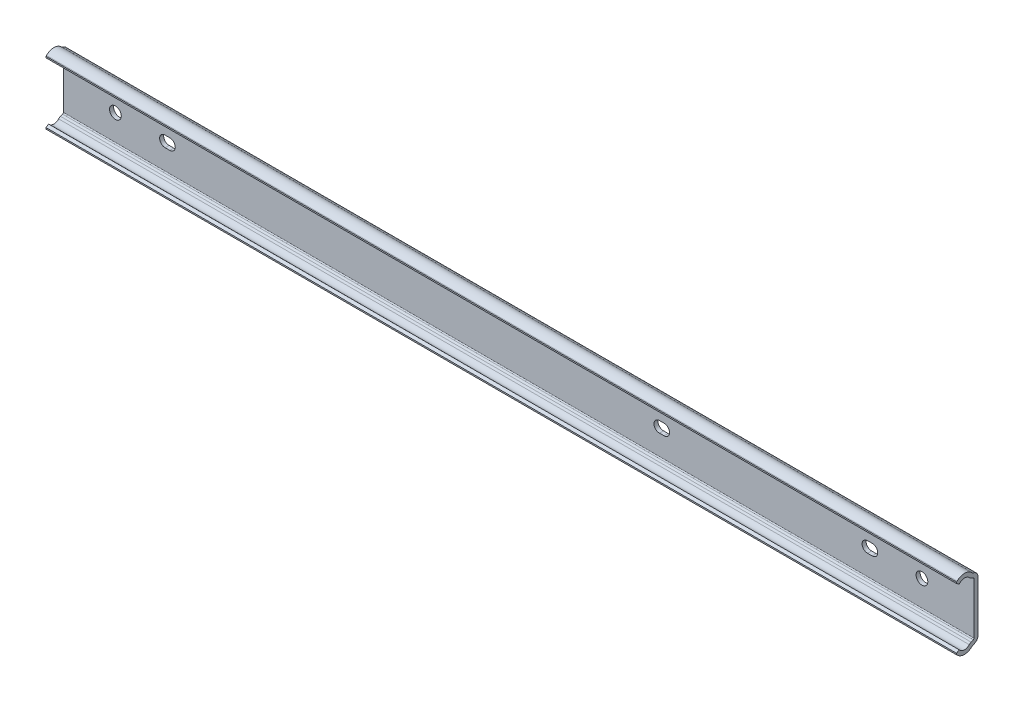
ISO-10303-21;
HEADER;
FILE_DESCRIPTION(('STEP AP214'),'2;1');
FILE_NAME('part.step','',(''),(''),'','','');
FILE_SCHEMA(('AUTOMOTIVE_DESIGN { 1 0 10303 214 1 1 1 1 }'));
ENDSEC;
DATA;
#1=APPLICATION_CONTEXT('core data for automotive mechanical design processes');
#2=APPLICATION_PROTOCOL_DEFINITION('international standard','automotive_design',2000,#1);
#3=PRODUCT_CONTEXT('',#1,'mechanical');
#4=PRODUCT('Part','Part','',(#3));
#5=PRODUCT_RELATED_PRODUCT_CATEGORY('part','',(#4));
#6=PRODUCT_DEFINITION_FORMATION('','',#4);
#7=PRODUCT_DEFINITION_CONTEXT('part definition',#1,'design');
#8=PRODUCT_DEFINITION('design','',#6,#7);
#9=PRODUCT_DEFINITION_SHAPE('','',#8);
#10=(LENGTH_UNIT() NAMED_UNIT(*) SI_UNIT(.MILLI.,.METRE.));
#11=(NAMED_UNIT(*) PLANE_ANGLE_UNIT() SI_UNIT($,.RADIAN.));
#12=(NAMED_UNIT(*) SI_UNIT($,.STERADIAN.) SOLID_ANGLE_UNIT());
#13=UNCERTAINTY_MEASURE_WITH_UNIT(LENGTH_MEASURE(1.E-05),#10,'distance_accuracy_value','');
#14=(GEOMETRIC_REPRESENTATION_CONTEXT(3) GLOBAL_UNCERTAINTY_ASSIGNED_CONTEXT((#13)) GLOBAL_UNIT_ASSIGNED_CONTEXT((#10,
#11,#12)) REPRESENTATION_CONTEXT('',''));
#15=CARTESIAN_POINT('',(0.,0.,0.));
#16=DIRECTION('',(0.,0.,1.));
#17=DIRECTION('',(1.,0.,0.));
#18=AXIS2_PLACEMENT_3D('',#15,#16,#17);
#19=CARTESIAN_POINT('',(-20.,12.543699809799,1.86234751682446));
#20=DIRECTION('',(1.,0.,0.));
#21=DIRECTION('',(0.,0.,1.));
#22=AXIS2_PLACEMENT_3D('',#19,#20,#21);
#23=CYLINDRICAL_SURFACE('',#22,0.499999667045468);
#24=CARTESIAN_POINT('',(330.,12.543699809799,1.86234751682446));
#25=DIRECTION('',(-1.,0.,0.));
#26=DIRECTION('',(0.,0.,-1.));
#27=AXIS2_PLACEMENT_3D('',#24,#25,#26);
#28=CIRCLE('',#27,0.499999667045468);
#29=CARTESIAN_POINT('',(330.,12.083447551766,2.05771262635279));
#30=VERTEX_POINT('',#29);
#31=CARTESIAN_POINT('',(330.,12.2044394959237,2.22963773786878));
#32=VERTEX_POINT('',#31);
#33=EDGE_CURVE('E366',#30,#32,#28,.T.);
#34=ORIENTED_EDGE('',*,*,#33,.F.);
#35=DIRECTION('',(1.,0.,0.));
#36=VECTOR('',#35,1.);
#37=CARTESIAN_POINT('',(-20.,12.083447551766,2.05771262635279));
#38=LINE('',#37,#36);
#39=CARTESIAN_POINT('',(-20.,12.083447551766,2.05771262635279));
#40=VERTEX_POINT('',#39);
#41=EDGE_CURVE('E9',#40,#30,#38,.T.);
#42=ORIENTED_EDGE('',*,*,#41,.F.);
#43=CARTESIAN_POINT('',(-20.,12.543699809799,1.86234751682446));
#44=DIRECTION('',(-1.,0.,0.));
#45=DIRECTION('',(0.,0.,-1.));
#46=AXIS2_PLACEMENT_3D('',#43,#44,#45);
#47=CIRCLE('',#46,0.499999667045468);
#48=CARTESIAN_POINT('',(-20.,12.2044394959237,2.22963773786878));
#49=VERTEX_POINT('',#48);
#50=EDGE_CURVE('E442',#40,#49,#47,.T.);
#51=ORIENTED_EDGE('',*,*,#50,.T.);
#52=DIRECTION('',(1.,0.,0.));
#53=VECTOR('',#52,1.);
#54=CARTESIAN_POINT('',(-20.,12.2044394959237,2.22963773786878));
#55=LINE('',#54,#53);
#56=EDGE_CURVE('E17',#49,#32,#55,.T.);
#57=ORIENTED_EDGE('',*,*,#56,.T.);
#58=EDGE_LOOP('',(#34,#42,#51,#57));
#59=FACE_BOUND('',#58,.T.);
#60=ADVANCED_FACE('F14',(#59),#23,.F.);
#61=CARTESIAN_POINT('',(-20.,12.083447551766,2.05771262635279));
#62=DIRECTION('',(0.,0.920504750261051,-0.390731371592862));
#63=DIRECTION('',(0.,0.390731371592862,0.920504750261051));
#64=AXIS2_PLACEMENT_3D('',#61,#62,#63);
#65=PLANE('',#64);
#66=DIRECTION('',(0.,0.390731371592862,0.920504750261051));
#67=VECTOR('',#66,1.);
#68=CARTESIAN_POINT('',(330.,12.083447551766,2.05771262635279));
#69=LINE('',#68,#67);
#70=CARTESIAN_POINT('',(330.,11.7401695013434,1.24900081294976));
#71=VERTEX_POINT('',#70);
#72=EDGE_CURVE('E440',#71,#30,#69,.T.);
#73=ORIENTED_EDGE('',*,*,#72,.F.);
#74=DIRECTION('',(1.,0.,0.));
#75=VECTOR('',#74,1.);
#76=CARTESIAN_POINT('',(-20.,11.7401695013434,1.24900081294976));
#77=LINE('',#76,#75);
#78=CARTESIAN_POINT('',(-20.,11.7401695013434,1.24900081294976));
#79=VERTEX_POINT('',#78);
#80=EDGE_CURVE('E22',#79,#71,#77,.T.);
#81=ORIENTED_EDGE('',*,*,#80,.F.);
#82=DIRECTION('',(0.,0.390731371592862,0.920504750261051));
#83=VECTOR('',#82,1.);
#84=CARTESIAN_POINT('',(-20.,12.083447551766,2.05771262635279));
#85=LINE('',#84,#83);
#86=EDGE_CURVE('E516',#79,#40,#85,.T.);
#87=ORIENTED_EDGE('',*,*,#86,.T.);
#88=ORIENTED_EDGE('',*,*,#41,.T.);
#89=EDGE_LOOP('',(#73,#81,#87,#88));
#90=FACE_BOUND('',#89,.T.);
#91=ADVANCED_FACE('F578',(#90),#65,.T.);
#92=CARTESIAN_POINT('',(-20.,9.85313511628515,2.04999938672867));
#93=DIRECTION('',(1.,0.,0.));
#94=DIRECTION('',(0.,0.,1.));
#95=AXIS2_PLACEMENT_3D('',#92,#93,#94);
#96=CYLINDRICAL_SURFACE('',#95,2.04999938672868);
#97=CARTESIAN_POINT('',(330.,9.85313511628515,2.04999938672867));
#98=DIRECTION('',(1.,0.,0.));
#99=DIRECTION('',(0.,0.,-1.));
#100=AXIS2_PLACEMENT_3D('',#97,#98,#99);
#101=CIRCLE('',#100,2.04999938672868);
#102=CARTESIAN_POINT('',(330.,9.85313511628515,0.));
#103=VERTEX_POINT('',#102);
#104=EDGE_CURVE('E437',#103,#71,#101,.T.);
#105=ORIENTED_EDGE('',*,*,#104,.F.);
#106=DIRECTION('',(1.,0.,0.));
#107=VECTOR('',#106,1.);
#108=CARTESIAN_POINT('',(-20.,9.85313511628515,0.));
#109=LINE('',#108,#107);
#110=CARTESIAN_POINT('',(-20.,9.85313511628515,0.));
#111=VERTEX_POINT('',#110);
#112=EDGE_CURVE('E519',#111,#103,#109,.T.);
#113=ORIENTED_EDGE('',*,*,#112,.F.);
#114=CARTESIAN_POINT('',(-20.,9.85313511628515,2.04999938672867));
#115=DIRECTION('',(1.,0.,0.));
#116=DIRECTION('',(0.,0.,-1.));
#117=AXIS2_PLACEMENT_3D('',#114,#115,#116);
#118=CIRCLE('',#117,2.04999938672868);
#119=EDGE_CURVE('E513',#111,#79,#118,.T.);
#120=ORIENTED_EDGE('',*,*,#119,.T.);
#121=ORIENTED_EDGE('',*,*,#80,.T.);
#122=EDGE_LOOP('',(#105,#113,#120,#121));
#123=FACE_BOUND('',#122,.T.);
#124=ADVANCED_FACE('F671',(#123),#96,.T.);
#125=CARTESIAN_POINT('',(-20.,9.85313511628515,0.));
#126=DIRECTION('',(0.,0.,-1.));
#127=DIRECTION('',(1.,0.,0.));
#128=AXIS2_PLACEMENT_3D('',#125,#126,#127);
#129=PLANE('',#128);
#130=CARTESIAN_POINT('',(0.,0.,0.));
#131=DIRECTION('',(0.,0.,1.));
#132=DIRECTION('',(-1.,0.,0.));
#133=AXIS2_PLACEMENT_3D('',#130,#131,#132);
#134=CIRCLE('',#133,2.24999999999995);
#135=CARTESIAN_POINT('',(-2.24999999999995,0.,0.));
#136=VERTEX_POINT('',#135);
#137=EDGE_CURVE('E1041',#136,#136,#134,.T.);
#138=ORIENTED_EDGE('',*,*,#137,.T.);
#139=EDGE_LOOP('',(#138));
#140=FACE_BOUND('',#139,.T.);
#141=CARTESIAN_POINT('',(19.1,0.,0.));
#142=DIRECTION('',(0.,0.,1.));
#143=DIRECTION('',(-1.,0.,0.));
#144=AXIS2_PLACEMENT_3D('',#141,#142,#143);
#145=CIRCLE('',#144,2.1);
#146=CARTESIAN_POINT('',(19.1,2.1,0.));
#147=VERTEX_POINT('',#146);
#148=CARTESIAN_POINT('',(19.1,-2.1,0.));
#149=VERTEX_POINT('',#148);
#150=EDGE_CURVE('E280',#147,#149,#145,.T.);
#151=ORIENTED_EDGE('',*,*,#150,.T.);
#152=DIRECTION('',(1.,0.,0.));
#153=VECTOR('',#152,1.);
#154=CARTESIAN_POINT('',(20.9,-2.1,0.));
#155=LINE('',#154,#153);
#156=CARTESIAN_POINT('',(20.9,-2.1,0.));
#157=VERTEX_POINT('',#156);
#158=EDGE_CURVE('E286',#149,#157,#155,.T.);
#159=ORIENTED_EDGE('',*,*,#158,.T.);
#160=CARTESIAN_POINT('',(20.9,0.,0.));
#161=DIRECTION('',(0.,0.,1.));
#162=DIRECTION('',(-1.,0.,0.));
#163=AXIS2_PLACEMENT_3D('',#160,#161,#162);
#164=CIRCLE('',#163,2.1);
#165=CARTESIAN_POINT('',(20.9,2.1,0.));
#166=VERTEX_POINT('',#165);
#167=EDGE_CURVE('E30',#157,#166,#164,.T.);
#168=ORIENTED_EDGE('',*,*,#167,.T.);
#169=DIRECTION('',(-1.,0.,0.));
#170=VECTOR('',#169,1.);
#171=CARTESIAN_POINT('',(20.9,2.1,0.));
#172=LINE('',#171,#170);
#173=EDGE_CURVE('E289',#166,#147,#172,.T.);
#174=ORIENTED_EDGE('',*,*,#173,.T.);
#175=EDGE_LOOP('',(#151,#159,#168,#174));
#176=FACE_BOUND('',#175,.T.);
#177=CARTESIAN_POINT('',(210.9,0.,0.));
#178=DIRECTION('',(0.,0.,1.));
#179=DIRECTION('',(-1.,0.,0.));
#180=AXIS2_PLACEMENT_3D('',#177,#178,#179);
#181=CIRCLE('',#180,2.1);
#182=CARTESIAN_POINT('',(210.9,-2.1,0.));
#183=VERTEX_POINT('',#182);
#184=CARTESIAN_POINT('',(210.9,2.1,0.));
#185=VERTEX_POINT('',#184);
#186=EDGE_CURVE('E307',#183,#185,#181,.T.);
#187=ORIENTED_EDGE('',*,*,#186,.T.);
#188=DIRECTION('',(-1.,0.,0.));
#189=VECTOR('',#188,1.);
#190=CARTESIAN_POINT('',(210.9,2.1,0.));
#191=LINE('',#190,#189);
#192=CARTESIAN_POINT('',(209.1,2.1,0.));
#193=VERTEX_POINT('',#192);
#194=EDGE_CURVE('E310',#185,#193,#191,.T.);
#195=ORIENTED_EDGE('',*,*,#194,.T.);
#196=CARTESIAN_POINT('',(209.1,0.,0.));
#197=DIRECTION('',(0.,0.,1.));
#198=DIRECTION('',(-1.,0.,0.));
#199=AXIS2_PLACEMENT_3D('',#196,#197,#198);
#200=CIRCLE('',#199,2.1);
#201=CARTESIAN_POINT('',(209.1,-2.1,0.));
#202=VERTEX_POINT('',#201);
#203=EDGE_CURVE('E313',#193,#202,#200,.T.);
#204=ORIENTED_EDGE('',*,*,#203,.T.);
#205=DIRECTION('',(1.,0.,0.));
#206=VECTOR('',#205,1.);
#207=CARTESIAN_POINT('',(210.9,-2.1,0.));
#208=LINE('',#207,#206);
#209=EDGE_CURVE('E316',#202,#183,#208,.T.);
#210=ORIENTED_EDGE('',*,*,#209,.T.);
#211=EDGE_LOOP('',(#187,#195,#204,#210));
#212=FACE_BOUND('',#211,.T.);
#213=CARTESIAN_POINT('',(290.9,0.,0.));
#214=DIRECTION('',(0.,0.,1.));
#215=DIRECTION('',(-1.,0.,0.));
#216=AXIS2_PLACEMENT_3D('',#213,#214,#215);
#217=CIRCLE('',#216,2.1);
#218=CARTESIAN_POINT('',(290.9,-2.1,0.));
#219=VERTEX_POINT('',#218);
#220=CARTESIAN_POINT('',(290.9,2.1,0.));
#221=VERTEX_POINT('',#220);
#222=EDGE_CURVE('E339',#219,#221,#217,.T.);
#223=ORIENTED_EDGE('',*,*,#222,.T.);
#224=DIRECTION('',(-1.,0.,0.));
#225=VECTOR('',#224,1.);
#226=CARTESIAN_POINT('',(290.9,2.1,0.));
#227=LINE('',#226,#225);
#228=CARTESIAN_POINT('',(289.1,2.1,0.));
#229=VERTEX_POINT('',#228);
#230=EDGE_CURVE('E342',#221,#229,#227,.T.);
#231=ORIENTED_EDGE('',*,*,#230,.T.);
#232=CARTESIAN_POINT('',(289.1,0.,0.));
#233=DIRECTION('',(0.,0.,1.));
#234=DIRECTION('',(-1.,0.,0.));
#235=AXIS2_PLACEMENT_3D('',#232,#233,#234);
#236=CIRCLE('',#235,2.1);
#237=CARTESIAN_POINT('',(289.1,-2.1,0.));
#238=VERTEX_POINT('',#237);
#239=EDGE_CURVE('E345',#229,#238,#236,.T.);
#240=ORIENTED_EDGE('',*,*,#239,.T.);
#241=DIRECTION('',(1.,0.,0.));
#242=VECTOR('',#241,1.);
#243=CARTESIAN_POINT('',(290.9,-2.1,0.));
#244=LINE('',#243,#242);
#245=EDGE_CURVE('E348',#238,#219,#244,.T.);
#246=ORIENTED_EDGE('',*,*,#245,.T.);
#247=EDGE_LOOP('',(#223,#231,#240,#246));
#248=FACE_BOUND('',#247,.T.);
#249=CARTESIAN_POINT('',(310.,0.,0.));
#250=DIRECTION('',(0.,0.,1.));
#251=DIRECTION('',(-1.,0.,0.));
#252=AXIS2_PLACEMENT_3D('',#249,#250,#251);
#253=CIRCLE('',#252,2.24999999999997);
#254=CARTESIAN_POINT('',(307.75,0.,0.));
#255=VERTEX_POINT('',#254);
#256=EDGE_CURVE('E363',#255,#255,#253,.T.);
#257=ORIENTED_EDGE('',*,*,#256,.T.);
#258=EDGE_LOOP('',(#257));
#259=FACE_BOUND('',#258,.T.);
#260=DIRECTION('',(0.,1.,0.));
#261=VECTOR('',#260,1.);
#262=CARTESIAN_POINT('',(330.,9.85313511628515,0.));
#263=LINE('',#262,#261);
#264=CARTESIAN_POINT('',(330.,-9.85313465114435,0.));
#265=VERTEX_POINT('',#264);
#266=EDGE_CURVE('E434',#265,#103,#263,.T.);
#267=ORIENTED_EDGE('',*,*,#266,.F.);
#268=DIRECTION('',(1.,0.,0.));
#269=VECTOR('',#268,1.);
#270=CARTESIAN_POINT('',(-20.,-9.85313465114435,0.));
#271=LINE('',#270,#269);
#272=CARTESIAN_POINT('',(-20.,-9.85313465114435,0.));
#273=VERTEX_POINT('',#272);
#274=EDGE_CURVE('E521',#273,#265,#271,.T.);
#275=ORIENTED_EDGE('',*,*,#274,.F.);
#276=DIRECTION('',(0.,1.,0.));
#277=VECTOR('',#276,1.);
#278=CARTESIAN_POINT('',(-20.,9.85313511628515,0.));
#279=LINE('',#278,#277);
#280=EDGE_CURVE('E510',#273,#111,#279,.T.);
#281=ORIENTED_EDGE('',*,*,#280,.T.);
#282=ORIENTED_EDGE('',*,*,#112,.T.);
#283=EDGE_LOOP('',(#267,#275,#281,#282));
#284=FACE_BOUND('',#283,.T.);
#285=ADVANCED_FACE('F669',(#140,#176,#212,#248,#259,#284),#129,.T.);
#286=CARTESIAN_POINT('',(-20.,-9.85313465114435,2.04999938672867));
#287=DIRECTION('',(1.,0.,0.));
#288=DIRECTION('',(0.,0.,1.));
#289=AXIS2_PLACEMENT_3D('',#286,#287,#288);
#290=CYLINDRICAL_SURFACE('',#289,2.04999938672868);
#291=CARTESIAN_POINT('',(330.,-9.85313465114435,2.04999938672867));
#292=DIRECTION('',(1.,0.,0.));
#293=DIRECTION('',(0.,0.,1.));
#294=AXIS2_PLACEMENT_3D('',#291,#292,#293);
#295=CIRCLE('',#294,2.04999938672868);
#296=CARTESIAN_POINT('',(330.,-11.7401690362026,1.24900081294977));
#297=VERTEX_POINT('',#296);
#298=EDGE_CURVE('E431',#297,#265,#295,.T.);
#299=ORIENTED_EDGE('',*,*,#298,.F.);
#300=DIRECTION('',(1.,0.,0.));
#301=VECTOR('',#300,1.);
#302=CARTESIAN_POINT('',(-20.,-11.7401690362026,1.24900081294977));
#303=LINE('',#302,#301);
#304=CARTESIAN_POINT('',(-20.,-11.7401690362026,1.24900081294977));
#305=VERTEX_POINT('',#304);
#306=EDGE_CURVE('E523',#305,#297,#303,.T.);
#307=ORIENTED_EDGE('',*,*,#306,.F.);
#308=CARTESIAN_POINT('',(-20.,-9.85313465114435,2.04999938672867));
#309=DIRECTION('',(1.,0.,0.));
#310=DIRECTION('',(0.,0.,1.));
#311=AXIS2_PLACEMENT_3D('',#308,#309,#310);
#312=CIRCLE('',#311,2.04999938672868);
#313=EDGE_CURVE('E507',#305,#273,#312,.T.);
#314=ORIENTED_EDGE('',*,*,#313,.T.);
#315=ORIENTED_EDGE('',*,*,#274,.T.);
#316=EDGE_LOOP('',(#299,#307,#314,#315));
#317=FACE_BOUND('',#316,.T.);
#318=ADVANCED_FACE('F665',(#317),#290,.T.);
#319=CARTESIAN_POINT('',(-20.,-12.0834470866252,2.05771262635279));
#320=DIRECTION('',(0.,-0.920504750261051,-0.390731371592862));
#321=DIRECTION('',(0.,0.390731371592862,-0.920504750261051));
#322=AXIS2_PLACEMENT_3D('',#319,#320,#321);
#323=PLANE('',#322);
#324=DIRECTION('',(0.,0.390731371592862,-0.920504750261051));
#325=VECTOR('',#324,1.);
#326=CARTESIAN_POINT('',(330.,-12.0834470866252,2.05771262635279));
#327=LINE('',#326,#325);
#328=CARTESIAN_POINT('',(330.,-12.0834470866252,2.05771262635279));
#329=VERTEX_POINT('',#328);
#330=EDGE_CURVE('E429',#329,#297,#327,.T.);
#331=ORIENTED_EDGE('',*,*,#330,.F.);
#332=DIRECTION('',(1.,0.,0.));
#333=VECTOR('',#332,1.);
#334=CARTESIAN_POINT('',(-20.,-12.0834470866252,2.05771262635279));
#335=LINE('',#334,#333);
#336=CARTESIAN_POINT('',(-20.,-12.0834470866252,2.05771262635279));
#337=VERTEX_POINT('',#336);
#338=EDGE_CURVE('E526',#337,#329,#335,.T.);
#339=ORIENTED_EDGE('',*,*,#338,.F.);
#340=DIRECTION('',(0.,0.390731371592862,-0.920504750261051));
#341=VECTOR('',#340,1.);
#342=CARTESIAN_POINT('',(-20.,-12.0834470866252,2.05771262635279));
#343=LINE('',#342,#341);
#344=EDGE_CURVE('E505',#337,#305,#343,.T.);
#345=ORIENTED_EDGE('',*,*,#344,.T.);
#346=ORIENTED_EDGE('',*,*,#306,.T.);
#347=EDGE_LOOP('',(#331,#339,#345,#346));
#348=FACE_BOUND('',#347,.T.);
#349=ADVANCED_FACE('F661',(#348),#323,.T.);
#350=CARTESIAN_POINT('',(-20.,-12.5436993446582,1.86234751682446));
#351=DIRECTION('',(1.,0.,0.));
#352=DIRECTION('',(0.,0.,1.));
#353=AXIS2_PLACEMENT_3D('',#350,#351,#352);
#354=CYLINDRICAL_SURFACE('',#353,0.499999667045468);
#355=CARTESIAN_POINT('',(330.,-12.5436993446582,1.86234751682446));
#356=DIRECTION('',(-1.,0.,0.));
#357=DIRECTION('',(0.,0.,1.));
#358=AXIS2_PLACEMENT_3D('',#355,#356,#357);
#359=CIRCLE('',#358,0.499999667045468);
#360=CARTESIAN_POINT('',(330.,-12.2044390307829,2.22963773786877));
#361=VERTEX_POINT('',#360);
#362=EDGE_CURVE('E426',#361,#329,#359,.T.);
#363=ORIENTED_EDGE('',*,*,#362,.F.);
#364=DIRECTION('',(1.,0.,0.));
#365=VECTOR('',#364,1.);
#366=CARTESIAN_POINT('',(-20.,-12.2044390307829,2.22963773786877));
#367=LINE('',#366,#365);
#368=CARTESIAN_POINT('',(-20.,-12.2044390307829,2.22963773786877));
#369=VERTEX_POINT('',#368);
#370=EDGE_CURVE('E528',#369,#361,#367,.T.);
#371=ORIENTED_EDGE('',*,*,#370,.F.);
#372=CARTESIAN_POINT('',(-20.,-12.5436993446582,1.86234751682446));
#373=DIRECTION('',(-1.,0.,0.));
#374=DIRECTION('',(0.,0.,1.));
#375=AXIS2_PLACEMENT_3D('',#372,#373,#374);
#376=CIRCLE('',#375,0.499999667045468);
#377=EDGE_CURVE('E502',#369,#337,#376,.T.);
#378=ORIENTED_EDGE('',*,*,#377,.T.);
#379=ORIENTED_EDGE('',*,*,#338,.T.);
#380=EDGE_LOOP('',(#363,#371,#378,#379));
#381=FACE_BOUND('',#380,.T.);
#382=ADVANCED_FACE('F656',(#381),#354,.F.);
#383=CARTESIAN_POINT('',(-20.,-9.46999953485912,5.18999931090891));
#384=DIRECTION('',(1.,0.,0.));
#385=DIRECTION('',(0.,0.,1.));
#386=AXIS2_PLACEMENT_3D('',#383,#384,#385);
#387=CYLINDRICAL_SURFACE('',#386,4.03000000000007);
#388=CARTESIAN_POINT('',(330.,-9.46999953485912,5.18999931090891));
#389=DIRECTION('',(1.,0.,0.));
#390=DIRECTION('',(0.,0.,1.));
#391=AXIS2_PLACEMENT_3D('',#388,#389,#390);
#392=CIRCLE('',#391,4.03000000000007);
#393=CARTESIAN_POINT('',(330.,-12.319639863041,8.03963963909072));
#394=VERTEX_POINT('',#393);
#395=EDGE_CURVE('E423',#394,#361,#392,.T.);
#396=ORIENTED_EDGE('',*,*,#395,.F.);
#397=DIRECTION('',(1.,0.,0.));
#398=VECTOR('',#397,1.);
#399=CARTESIAN_POINT('',(-20.,-12.319639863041,8.03963963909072));
#400=LINE('',#399,#398);
#401=CARTESIAN_POINT('',(-20.,-12.319639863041,8.03963963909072));
#402=VERTEX_POINT('',#401);
#403=EDGE_CURVE('E530',#402,#394,#400,.T.);
#404=ORIENTED_EDGE('',*,*,#403,.F.);
#405=CARTESIAN_POINT('',(-20.,-9.46999953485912,5.18999931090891));
#406=DIRECTION('',(1.,0.,0.));
#407=DIRECTION('',(0.,0.,1.));
#408=AXIS2_PLACEMENT_3D('',#405,#406,#407);
#409=CIRCLE('',#408,4.03000000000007);
#410=EDGE_CURVE('E499',#402,#369,#409,.T.);
#411=ORIENTED_EDGE('',*,*,#410,.T.);
#412=ORIENTED_EDGE('',*,*,#370,.T.);
#413=EDGE_LOOP('',(#396,#404,#411,#412));
#414=FACE_BOUND('',#413,.T.);
#415=ADVANCED_FACE('F652',(#414),#387,.T.);
#416=CARTESIAN_POINT('',(-20.,-12.319639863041,8.03963963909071));
#417=DIRECTION('',(0.,-0.707107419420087,0.707106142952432));
#418=DIRECTION('',(0.,-0.707106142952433,-0.707107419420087));
#419=AXIS2_PLACEMENT_3D('',#416,#417,#418);
#420=PLANE('',#419);
#421=DIRECTION('',(0.,-0.707106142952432,-0.707107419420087));
#422=VECTOR('',#421,1.);
#423=CARTESIAN_POINT('',(330.,-12.319639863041,8.03963963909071));
#424=LINE('',#423,#422);
#425=CARTESIAN_POINT('',(330.,-12.1292805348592,8.22999931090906));
#426=VERTEX_POINT('',#425);
#427=EDGE_CURVE('E420',#426,#394,#424,.T.);
#428=ORIENTED_EDGE('',*,*,#427,.F.);
#429=DIRECTION('',(1.,0.,0.));
#430=VECTOR('',#429,1.);
#431=CARTESIAN_POINT('',(-20.,-12.1292805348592,8.22999931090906));
#432=LINE('',#431,#430);
#433=CARTESIAN_POINT('',(-20.,-12.1292805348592,8.22999931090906));
#434=VERTEX_POINT('',#433);
#435=EDGE_CURVE('E532',#434,#426,#432,.T.);
#436=ORIENTED_EDGE('',*,*,#435,.F.);
#437=DIRECTION('',(0.,-0.707106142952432,-0.707107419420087));
#438=VECTOR('',#437,1.);
#439=CARTESIAN_POINT('',(-20.,-12.319639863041,8.03963963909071));
#440=LINE('',#439,#438);
#441=EDGE_CURVE('E496',#434,#402,#440,.T.);
#442=ORIENTED_EDGE('',*,*,#441,.T.);
#443=ORIENTED_EDGE('',*,*,#403,.T.);
#444=EDGE_LOOP('',(#428,#436,#442,#443));
#445=FACE_BOUND('',#444,.T.);
#446=ADVANCED_FACE('F648',(#445),#420,.T.);
#447=CARTESIAN_POINT('',(-20.,-12.1292805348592,8.22999931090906));
#448=DIRECTION('',(0.,2.09219452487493E-13,1.));
#449=DIRECTION('',(0.,-1.,2.09219452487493E-13));
#450=AXIS2_PLACEMENT_3D('',#447,#448,#449);
#451=PLANE('',#450);
#452=DIRECTION('',(0.,-1.,2.09219452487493E-13));
#453=VECTOR('',#452,1.);
#454=CARTESIAN_POINT('',(330.,-12.1292805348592,8.22999931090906));
#455=LINE('',#454,#453);
#456=CARTESIAN_POINT('',(330.,-11.598630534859,8.22999931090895));
#457=VERTEX_POINT('',#456);
#458=EDGE_CURVE('E417',#457,#426,#455,.T.);
#459=ORIENTED_EDGE('',*,*,#458,.F.);
#460=DIRECTION('',(1.,0.,0.));
#461=VECTOR('',#460,1.);
#462=CARTESIAN_POINT('',(-20.,-11.598630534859,8.22999931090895));
#463=LINE('',#462,#461);
#464=CARTESIAN_POINT('',(-20.,-11.598630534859,8.22999931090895));
#465=VERTEX_POINT('',#464);
#466=EDGE_CURVE('E534',#465,#457,#463,.T.);
#467=ORIENTED_EDGE('',*,*,#466,.F.);
#468=DIRECTION('',(0.,-1.,2.09219452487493E-13));
#469=VECTOR('',#468,1.);
#470=CARTESIAN_POINT('',(-20.,-12.1292805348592,8.22999931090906));
#471=LINE('',#470,#469);
#472=EDGE_CURVE('E493',#465,#434,#471,.T.);
#473=ORIENTED_EDGE('',*,*,#472,.T.);
#474=ORIENTED_EDGE('',*,*,#435,.T.);
#475=EDGE_LOOP('',(#459,#467,#473,#474));
#476=FACE_BOUND('',#475,.T.);
#477=ADVANCED_FACE('F644',(#476),#451,.T.);
#478=CARTESIAN_POINT('',(-20.,-10.9144125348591,7.25283531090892));
#479=DIRECTION('',(0.,0.819151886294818,0.573576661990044));
#480=DIRECTION('',(0.,-0.573576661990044,0.819151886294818));
#481=AXIS2_PLACEMENT_3D('',#478,#479,#480);
#482=PLANE('',#481);
#483=DIRECTION('',(0.,-0.573576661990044,0.819151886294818));
#484=VECTOR('',#483,1.);
#485=CARTESIAN_POINT('',(330.,-10.9144125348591,7.25283531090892));
#486=LINE('',#485,#484);
#487=CARTESIAN_POINT('',(330.,-10.9144125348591,7.25283531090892));
#488=VERTEX_POINT('',#487);
#489=EDGE_CURVE('E414',#488,#457,#486,.T.);
#490=ORIENTED_EDGE('',*,*,#489,.F.);
#491=DIRECTION('',(1.,0.,0.));
#492=VECTOR('',#491,1.);
#493=CARTESIAN_POINT('',(-20.,-10.9144125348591,7.25283531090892));
#494=LINE('',#493,#492);
#495=CARTESIAN_POINT('',(-20.,-10.9144125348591,7.25283531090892));
#496=VERTEX_POINT('',#495);
#497=EDGE_CURVE('E536',#496,#488,#494,.T.);
#498=ORIENTED_EDGE('',*,*,#497,.F.);
#499=DIRECTION('',(0.,-0.573576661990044,0.819151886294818));
#500=VECTOR('',#499,1.);
#501=CARTESIAN_POINT('',(-20.,-10.9144125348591,7.25283531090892));
#502=LINE('',#501,#500);
#503=EDGE_CURVE('E490',#496,#465,#502,.T.);
#504=ORIENTED_EDGE('',*,*,#503,.T.);
#505=ORIENTED_EDGE('',*,*,#466,.T.);
#506=EDGE_LOOP('',(#490,#498,#504,#505));
#507=FACE_BOUND('',#506,.T.);
#508=ADVANCED_FACE('F640',(#507),#482,.T.);
#509=CARTESIAN_POINT('',(-20.,-11.2236243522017,6.94362412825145));
#510=DIRECTION('',(0.,0.707106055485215,-0.707107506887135));
#511=DIRECTION('',(0.,0.707107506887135,0.707106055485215));
#512=AXIS2_PLACEMENT_3D('',#509,#510,#511);
#513=PLANE('',#512);
#514=DIRECTION('',(0.,0.707107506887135,0.707106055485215));
#515=VECTOR('',#514,1.);
#516=CARTESIAN_POINT('',(330.,-11.2236243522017,6.94362412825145));
#517=LINE('',#516,#515);
#518=CARTESIAN_POINT('',(330.,-11.2236243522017,6.94362412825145));
#519=VERTEX_POINT('',#518);
#520=EDGE_CURVE('E411',#519,#488,#517,.T.);
#521=ORIENTED_EDGE('',*,*,#520,.F.);
#522=DIRECTION('',(1.,0.,0.));
#523=VECTOR('',#522,1.);
#524=CARTESIAN_POINT('',(-20.,-11.2236243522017,6.94362412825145));
#525=LINE('',#524,#523);
#526=CARTESIAN_POINT('',(-20.,-11.2236243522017,6.94362412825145));
#527=VERTEX_POINT('',#526);
#528=EDGE_CURVE('E538',#527,#519,#525,.T.);
#529=ORIENTED_EDGE('',*,*,#528,.F.);
#530=DIRECTION('',(0.,0.707107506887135,0.707106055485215));
#531=VECTOR('',#530,1.);
#532=CARTESIAN_POINT('',(-20.,-11.2236243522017,6.94362412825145));
#533=LINE('',#532,#531);
#534=EDGE_CURVE('E487',#527,#496,#533,.T.);
#535=ORIENTED_EDGE('',*,*,#534,.T.);
#536=ORIENTED_EDGE('',*,*,#497,.T.);
#537=EDGE_LOOP('',(#521,#529,#535,#536));
#538=FACE_BOUND('',#537,.T.);
#539=ADVANCED_FACE('F636',(#538),#513,.T.);
#540=CARTESIAN_POINT('',(-20.,-9.46999953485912,5.18999931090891));
#541=DIRECTION('',(1.,0.,0.));
#542=DIRECTION('',(0.,0.,1.));
#543=AXIS2_PLACEMENT_3D('',#540,#541,#542);
#544=CYLINDRICAL_SURFACE('',#543,2.47999999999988);
#545=CARTESIAN_POINT('',(330.,-9.46999953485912,5.18999931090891));
#546=DIRECTION('',(-1.,0.,0.));
#547=DIRECTION('',(0.,0.,1.));
#548=AXIS2_PLACEMENT_3D('',#545,#546,#547);
#549=CIRCLE('',#548,2.47999999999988);
#550=CARTESIAN_POINT('',(330.,-11.1527315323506,3.36823834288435));
#551=VERTEX_POINT('',#550);
#552=EDGE_CURVE('E408',#551,#519,#549,.T.);
#553=ORIENTED_EDGE('',*,*,#552,.F.);
#554=DIRECTION('',(1.,0.,0.));
#555=VECTOR('',#554,1.);
#556=CARTESIAN_POINT('',(-20.,-11.1527315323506,3.36823834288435));
#557=LINE('',#556,#555);
#558=CARTESIAN_POINT('',(-20.,-11.1527315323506,3.36823834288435));
#559=VERTEX_POINT('',#558);
#560=EDGE_CURVE('E540',#559,#551,#557,.T.);
#561=ORIENTED_EDGE('',*,*,#560,.F.);
#562=CARTESIAN_POINT('',(-20.,-9.46999953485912,5.18999931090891));
#563=DIRECTION('',(-1.,0.,0.));
#564=DIRECTION('',(0.,0.,1.));
#565=AXIS2_PLACEMENT_3D('',#562,#563,#564);
#566=CIRCLE('',#565,2.47999999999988);
#567=EDGE_CURVE('E484',#559,#527,#566,.T.);
#568=ORIENTED_EDGE('',*,*,#567,.T.);
#569=ORIENTED_EDGE('',*,*,#528,.T.);
#570=EDGE_LOOP('',(#553,#561,#568,#569));
#571=FACE_BOUND('',#570,.T.);
#572=ADVANCED_FACE('F632',(#571),#544,.F.);
#573=CARTESIAN_POINT('',(-20.,-12.5436993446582,1.86234751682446));
#574=DIRECTION('',(1.,0.,0.));
#575=DIRECTION('',(0.,0.,1.));
#576=AXIS2_PLACEMENT_3D('',#573,#574,#575);
#577=CYLINDRICAL_SURFACE('',#576,2.04999966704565);
#578=CARTESIAN_POINT('',(330.,-12.5436993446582,1.86234751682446));
#579=DIRECTION('',(1.,0.,0.));
#580=DIRECTION('',(0.,0.,1.));
#581=AXIS2_PLACEMENT_3D('',#578,#579,#580);
#582=CIRCLE('',#581,2.04999966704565);
#583=CARTESIAN_POINT('',(330.,-10.6566647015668,2.66334620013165));
#584=VERTEX_POINT('',#583);
#585=EDGE_CURVE('E405',#584,#551,#582,.T.);
#586=ORIENTED_EDGE('',*,*,#585,.F.);
#587=DIRECTION('',(1.,0.,0.));
#588=VECTOR('',#587,1.);
#589=CARTESIAN_POINT('',(-20.,-10.6566647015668,2.66334620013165));
#590=LINE('',#589,#588);
#591=CARTESIAN_POINT('',(-20.,-10.6566647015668,2.66334620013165));
#592=VERTEX_POINT('',#591);
#593=EDGE_CURVE('E542',#592,#584,#590,.T.);
#594=ORIENTED_EDGE('',*,*,#593,.F.);
#595=CARTESIAN_POINT('',(-20.,-12.5436993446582,1.86234751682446));
#596=DIRECTION('',(1.,0.,0.));
#597=DIRECTION('',(0.,0.,1.));
#598=AXIS2_PLACEMENT_3D('',#595,#596,#597);
#599=CIRCLE('',#598,2.04999966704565);
#600=EDGE_CURVE('E481',#592,#559,#599,.T.);
#601=ORIENTED_EDGE('',*,*,#600,.T.);
#602=ORIENTED_EDGE('',*,*,#560,.T.);
#603=EDGE_LOOP('',(#586,#594,#601,#602));
#604=FACE_BOUND('',#603,.T.);
#605=ADVANCED_FACE('F628',(#604),#577,.T.);
#606=CARTESIAN_POINT('',(-20.,-10.6566647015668,2.66334620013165));
#607=DIRECTION('',(0.,0.920505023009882,0.390730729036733));
#608=DIRECTION('',(0.,-0.390730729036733,0.920505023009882));
#609=AXIS2_PLACEMENT_3D('',#606,#607,#608);
#610=PLANE('',#609);
#611=DIRECTION('',(0.,-0.390730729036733,0.920505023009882));
#612=VECTOR('',#611,1.);
#613=CARTESIAN_POINT('',(330.,-10.6566647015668,2.66334620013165));
#614=LINE('',#613,#612);
#615=CARTESIAN_POINT('',(330.,-10.3133870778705,1.85463382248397));
#616=VERTEX_POINT('',#615);
#617=EDGE_CURVE('E402',#616,#584,#614,.T.);
#618=ORIENTED_EDGE('',*,*,#617,.F.);
#619=DIRECTION('',(1.,0.,0.));
#620=VECTOR('',#619,1.);
#621=CARTESIAN_POINT('',(-20.,-10.3133870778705,1.85463382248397));
#622=LINE('',#621,#620);
#623=CARTESIAN_POINT('',(-20.,-10.3133870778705,1.85463382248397));
#624=VERTEX_POINT('',#623);
#625=EDGE_CURVE('E544',#624,#616,#622,.T.);
#626=ORIENTED_EDGE('',*,*,#625,.F.);
#627=DIRECTION('',(0.,-0.390730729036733,0.920505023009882));
#628=VECTOR('',#627,1.);
#629=CARTESIAN_POINT('',(-20.,-10.6566647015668,2.66334620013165));
#630=LINE('',#629,#628);
#631=EDGE_CURVE('E478',#624,#592,#630,.T.);
#632=ORIENTED_EDGE('',*,*,#631,.T.);
#633=ORIENTED_EDGE('',*,*,#593,.T.);
#634=EDGE_LOOP('',(#618,#626,#632,#633));
#635=FACE_BOUND('',#634,.T.);
#636=ADVANCED_FACE('F624',(#635),#610,.T.);
#637=CARTESIAN_POINT('',(-20.,-9.85313465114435,2.04999938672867));
#638=DIRECTION('',(1.,0.,0.));
#639=DIRECTION('',(0.,0.,1.));
#640=AXIS2_PLACEMENT_3D('',#637,#638,#639);
#641=CYLINDRICAL_SURFACE('',#640,0.499999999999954);
#642=CARTESIAN_POINT('',(330.,-9.85313465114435,2.04999938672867));
#643=DIRECTION('',(-1.,0.,0.));
#644=DIRECTION('',(0.,0.,1.));
#645=AXIS2_PLACEMENT_3D('',#642,#643,#644);
#646=CIRCLE('',#645,0.499999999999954);
#647=CARTESIAN_POINT('',(330.,-9.85313465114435,1.54999938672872));
#648=VERTEX_POINT('',#647);
#649=EDGE_CURVE('E399',#648,#616,#646,.T.);
#650=ORIENTED_EDGE('',*,*,#649,.F.);
#651=DIRECTION('',(1.,0.,0.));
#652=VECTOR('',#651,1.);
#653=CARTESIAN_POINT('',(-20.,-9.85313465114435,1.54999938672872));
#654=LINE('',#653,#652);
#655=CARTESIAN_POINT('',(-20.,-9.85313465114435,1.54999938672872));
#656=VERTEX_POINT('',#655);
#657=EDGE_CURVE('E546',#656,#648,#654,.T.);
#658=ORIENTED_EDGE('',*,*,#657,.F.);
#659=CARTESIAN_POINT('',(-20.,-9.85313465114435,2.04999938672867));
#660=DIRECTION('',(-1.,0.,0.));
#661=DIRECTION('',(0.,0.,1.));
#662=AXIS2_PLACEMENT_3D('',#659,#660,#661);
#663=CIRCLE('',#662,0.499999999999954);
#664=EDGE_CURVE('E475',#656,#624,#663,.T.);
#665=ORIENTED_EDGE('',*,*,#664,.T.);
#666=ORIENTED_EDGE('',*,*,#625,.T.);
#667=EDGE_LOOP('',(#650,#658,#665,#666));
#668=FACE_BOUND('',#667,.T.);
#669=ADVANCED_FACE('F620',(#668),#641,.F.);
#670=CARTESIAN_POINT('',(-20.,9.85313511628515,1.54999938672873));
#671=DIRECTION('',(0.,0.,1.));
#672=DIRECTION('',(-1.,0.,0.));
#673=AXIS2_PLACEMENT_3D('',#670,#671,#672);
#674=PLANE('',#673);
#675=CARTESIAN_POINT('',(0.,0.,1.54999938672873));
#676=DIRECTION('',(0.,0.,1.));
#677=DIRECTION('',(-1.,0.,0.));
#678=AXIS2_PLACEMENT_3D('',#675,#676,#677);
#679=CIRCLE('',#678,2.24999999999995);
#680=CARTESIAN_POINT('',(-2.24999999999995,0.,1.54999938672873));
#681=VERTEX_POINT('',#680);
#682=EDGE_CURVE('E1044',#681,#681,#679,.T.);
#683=ORIENTED_EDGE('',*,*,#682,.F.);
#684=EDGE_LOOP('',(#683));
#685=FACE_BOUND('',#684,.T.);
#686=CARTESIAN_POINT('',(19.1,0.,1.54999938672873));
#687=DIRECTION('',(0.,0.,1.));
#688=DIRECTION('',(-1.,0.,0.));
#689=AXIS2_PLACEMENT_3D('',#686,#687,#688);
#690=CIRCLE('',#689,2.1);
#691=CARTESIAN_POINT('',(19.1,2.1,1.54999938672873));
#692=VERTEX_POINT('',#691);
#693=CARTESIAN_POINT('',(19.1,-2.1,1.54999938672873));
#694=VERTEX_POINT('',#693);
#695=EDGE_CURVE('E38',#692,#694,#690,.T.);
#696=ORIENTED_EDGE('',*,*,#695,.F.);
#697=DIRECTION('',(-1.,0.,0.));
#698=VECTOR('',#697,1.);
#699=CARTESIAN_POINT('',(20.9,2.1,1.54999938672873));
#700=LINE('',#699,#698);
#701=CARTESIAN_POINT('',(20.9,2.1,1.54999938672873));
#702=VERTEX_POINT('',#701);
#703=EDGE_CURVE('E278',#702,#692,#700,.T.);
#704=ORIENTED_EDGE('',*,*,#703,.F.);
#705=CARTESIAN_POINT('',(20.9,0.,1.54999938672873));
#706=DIRECTION('',(0.,0.,1.));
#707=DIRECTION('',(-1.,0.,0.));
#708=AXIS2_PLACEMENT_3D('',#705,#706,#707);
#709=CIRCLE('',#708,2.1);
#710=CARTESIAN_POINT('',(20.9,-2.1,1.54999938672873));
#711=VERTEX_POINT('',#710);
#712=EDGE_CURVE('E262',#711,#702,#709,.T.);
#713=ORIENTED_EDGE('',*,*,#712,.F.);
#714=DIRECTION('',(1.,0.,0.));
#715=VECTOR('',#714,1.);
#716=CARTESIAN_POINT('',(20.9,-2.1,1.54999938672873));
#717=LINE('',#716,#715);
#718=EDGE_CURVE('E271',#694,#711,#717,.T.);
#719=ORIENTED_EDGE('',*,*,#718,.F.);
#720=EDGE_LOOP('',(#696,#704,#713,#719));
#721=FACE_BOUND('',#720,.T.);
#722=CARTESIAN_POINT('',(210.9,0.,1.54999938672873));
#723=DIRECTION('',(0.,0.,1.));
#724=DIRECTION('',(-1.,0.,0.));
#725=AXIS2_PLACEMENT_3D('',#722,#723,#724);
#726=CIRCLE('',#725,2.1);
#727=CARTESIAN_POINT('',(210.9,-2.1,1.54999938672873));
#728=VERTEX_POINT('',#727);
#729=CARTESIAN_POINT('',(210.9,2.1,1.54999938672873));
#730=VERTEX_POINT('',#729);
#731=EDGE_CURVE('E294',#728,#730,#726,.T.);
#732=ORIENTED_EDGE('',*,*,#731,.F.);
#733=DIRECTION('',(1.,0.,0.));
#734=VECTOR('',#733,1.);
#735=CARTESIAN_POINT('',(210.9,-2.1,1.54999938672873));
#736=LINE('',#735,#734);
#737=CARTESIAN_POINT('',(209.1,-2.1,1.54999938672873));
#738=VERTEX_POINT('',#737);
#739=EDGE_CURVE('E304',#738,#728,#736,.T.);
#740=ORIENTED_EDGE('',*,*,#739,.F.);
#741=CARTESIAN_POINT('',(209.1,0.,1.54999938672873));
#742=DIRECTION('',(0.,0.,1.));
#743=DIRECTION('',(-1.,0.,0.));
#744=AXIS2_PLACEMENT_3D('',#741,#742,#743);
#745=CIRCLE('',#744,2.1);
#746=CARTESIAN_POINT('',(209.1,2.1,1.54999938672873));
#747=VERTEX_POINT('',#746);
#748=EDGE_CURVE('E301',#747,#738,#745,.T.);
#749=ORIENTED_EDGE('',*,*,#748,.F.);
#750=DIRECTION('',(-1.,0.,0.));
#751=VECTOR('',#750,1.);
#752=CARTESIAN_POINT('',(210.9,2.1,1.54999938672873));
#753=LINE('',#752,#751);
#754=EDGE_CURVE('E298',#730,#747,#753,.T.);
#755=ORIENTED_EDGE('',*,*,#754,.F.);
#756=EDGE_LOOP('',(#732,#740,#749,#755));
#757=FACE_BOUND('',#756,.T.);
#758=CARTESIAN_POINT('',(290.9,0.,1.54999938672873));
#759=DIRECTION('',(0.,0.,1.));
#760=DIRECTION('',(-1.,0.,0.));
#761=AXIS2_PLACEMENT_3D('',#758,#759,#760);
#762=CIRCLE('',#761,2.1);
#763=CARTESIAN_POINT('',(290.9,-2.1,1.54999938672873));
#764=VERTEX_POINT('',#763);
#765=CARTESIAN_POINT('',(290.9,2.1,1.54999938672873));
#766=VERTEX_POINT('',#765);
#767=EDGE_CURVE('E322',#764,#766,#762,.T.);
#768=ORIENTED_EDGE('',*,*,#767,.F.);
#769=DIRECTION('',(1.,0.,0.));
#770=VECTOR('',#769,1.);
#771=CARTESIAN_POINT('',(290.9,-2.1,1.54999938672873));
#772=LINE('',#771,#770);
#773=CARTESIAN_POINT('',(289.1,-2.1,1.54999938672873));
#774=VERTEX_POINT('',#773);
#775=EDGE_CURVE('E336',#774,#764,#772,.T.);
#776=ORIENTED_EDGE('',*,*,#775,.F.);
#777=CARTESIAN_POINT('',(289.1,0.,1.54999938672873));
#778=DIRECTION('',(0.,0.,1.));
#779=DIRECTION('',(-1.,0.,0.));
#780=AXIS2_PLACEMENT_3D('',#777,#778,#779);
#781=CIRCLE('',#780,2.1);
#782=CARTESIAN_POINT('',(289.1,2.1,1.54999938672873));
#783=VERTEX_POINT('',#782);
#784=EDGE_CURVE('E333',#783,#774,#781,.T.);
#785=ORIENTED_EDGE('',*,*,#784,.F.);
#786=DIRECTION('',(-1.,0.,0.));
#787=VECTOR('',#786,1.);
#788=CARTESIAN_POINT('',(290.9,2.1,1.54999938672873));
#789=LINE('',#788,#787);
#790=EDGE_CURVE('E330',#766,#783,#789,.T.);
#791=ORIENTED_EDGE('',*,*,#790,.F.);
#792=EDGE_LOOP('',(#768,#776,#785,#791));
#793=FACE_BOUND('',#792,.T.);
#794=CARTESIAN_POINT('',(310.,0.,1.54999938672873));
#795=DIRECTION('',(0.,0.,1.));
#796=DIRECTION('',(-1.,0.,0.));
#797=AXIS2_PLACEMENT_3D('',#794,#795,#796);
#798=CIRCLE('',#797,2.24999999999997);
#799=CARTESIAN_POINT('',(307.75,0.,1.54999938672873));
#800=VERTEX_POINT('',#799);
#801=EDGE_CURVE('E354',#800,#800,#798,.T.);
#802=ORIENTED_EDGE('',*,*,#801,.F.);
#803=EDGE_LOOP('',(#802));
#804=FACE_BOUND('',#803,.T.);
#805=DIRECTION('',(0.,-1.,0.));
#806=VECTOR('',#805,1.);
#807=CARTESIAN_POINT('',(330.,9.85313511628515,1.54999938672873));
#808=LINE('',#807,#806);
#809=CARTESIAN_POINT('',(330.,9.85313511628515,1.54999938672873));
#810=VERTEX_POINT('',#809);
#811=EDGE_CURVE('E396',#810,#648,#808,.T.);
#812=ORIENTED_EDGE('',*,*,#811,.F.);
#813=DIRECTION('',(1.,0.,0.));
#814=VECTOR('',#813,1.);
#815=CARTESIAN_POINT('',(-20.,9.85313511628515,1.54999938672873));
#816=LINE('',#815,#814);
#817=CARTESIAN_POINT('',(-20.,9.85313511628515,1.54999938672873));
#818=VERTEX_POINT('',#817);
#819=EDGE_CURVE('E548',#818,#810,#816,.T.);
#820=ORIENTED_EDGE('',*,*,#819,.F.);
#821=DIRECTION('',(0.,-1.,0.));
#822=VECTOR('',#821,1.);
#823=CARTESIAN_POINT('',(-20.,9.85313511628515,1.54999938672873));
#824=LINE('',#823,#822);
#825=EDGE_CURVE('E472',#818,#656,#824,.T.);
#826=ORIENTED_EDGE('',*,*,#825,.T.);
#827=ORIENTED_EDGE('',*,*,#657,.T.);
#828=EDGE_LOOP('',(#812,#820,#826,#827));
#829=FACE_BOUND('',#828,.T.);
#830=ADVANCED_FACE('F275',(#685,#721,#757,#793,#804,#829),#674,.T.);
#831=CARTESIAN_POINT('',(-20.,9.85313511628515,2.04999938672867));
#832=DIRECTION('',(1.,0.,0.));
#833=DIRECTION('',(0.,0.,1.));
#834=AXIS2_PLACEMENT_3D('',#831,#832,#833);
#835=CYLINDRICAL_SURFACE('',#834,0.499999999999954);
#836=CARTESIAN_POINT('',(330.,9.85313511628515,2.04999938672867));
#837=DIRECTION('',(-1.,0.,0.));
#838=DIRECTION('',(0.,0.,-1.));
#839=AXIS2_PLACEMENT_3D('',#836,#837,#838);
#840=CIRCLE('',#839,0.499999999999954);
#841=CARTESIAN_POINT('',(330.,10.3133875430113,1.85463382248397));
#842=VERTEX_POINT('',#841);
#843=EDGE_CURVE('E393',#842,#810,#840,.T.);
#844=ORIENTED_EDGE('',*,*,#843,.F.);
#845=DIRECTION('',(1.,0.,0.));
#846=VECTOR('',#845,1.);
#847=CARTESIAN_POINT('',(-20.,10.3133875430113,1.85463382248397));
#848=LINE('',#847,#846);
#849=CARTESIAN_POINT('',(-20.,10.3133875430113,1.85463382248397));
#850=VERTEX_POINT('',#849);
#851=EDGE_CURVE('E550',#850,#842,#848,.T.);
#852=ORIENTED_EDGE('',*,*,#851,.F.);
#853=CARTESIAN_POINT('',(-20.,9.85313511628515,2.04999938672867));
#854=DIRECTION('',(-1.,0.,0.));
#855=DIRECTION('',(0.,0.,-1.));
#856=AXIS2_PLACEMENT_3D('',#853,#854,#855);
#857=CIRCLE('',#856,0.499999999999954);
#858=EDGE_CURVE('E469',#850,#818,#857,.T.);
#859=ORIENTED_EDGE('',*,*,#858,.T.);
#860=ORIENTED_EDGE('',*,*,#819,.T.);
#861=EDGE_LOOP('',(#844,#852,#859,#860));
#862=FACE_BOUND('',#861,.T.);
#863=ADVANCED_FACE('F613',(#862),#835,.F.);
#864=CARTESIAN_POINT('',(-20.,10.6566651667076,2.66334620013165));
#865=DIRECTION('',(0.,-0.920505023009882,0.390730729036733));
#866=DIRECTION('',(0.,-0.390730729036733,-0.920505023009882));
#867=AXIS2_PLACEMENT_3D('',#864,#865,#866);
#868=PLANE('',#867);
#869=DIRECTION('',(0.,-0.390730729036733,-0.920505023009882));
#870=VECTOR('',#869,1.);
#871=CARTESIAN_POINT('',(330.,10.6566651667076,2.66334620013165));
#872=LINE('',#871,#870);
#873=CARTESIAN_POINT('',(330.,10.6566651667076,2.66334620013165));
#874=VERTEX_POINT('',#873);
#875=EDGE_CURVE('E390',#874,#842,#872,.T.);
#876=ORIENTED_EDGE('',*,*,#875,.F.);
#877=DIRECTION('',(1.,0.,0.));
#878=VECTOR('',#877,1.);
#879=CARTESIAN_POINT('',(-20.,10.6566651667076,2.66334620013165));
#880=LINE('',#879,#878);
#881=CARTESIAN_POINT('',(-20.,10.6566651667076,2.66334620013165));
#882=VERTEX_POINT('',#881);
#883=EDGE_CURVE('E552',#882,#874,#880,.T.);
#884=ORIENTED_EDGE('',*,*,#883,.F.);
#885=DIRECTION('',(0.,-0.390730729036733,-0.920505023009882));
#886=VECTOR('',#885,1.);
#887=CARTESIAN_POINT('',(-20.,10.6566651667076,2.66334620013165));
#888=LINE('',#887,#886);
#889=EDGE_CURVE('E466',#882,#850,#888,.T.);
#890=ORIENTED_EDGE('',*,*,#889,.T.);
#891=ORIENTED_EDGE('',*,*,#851,.T.);
#892=EDGE_LOOP('',(#876,#884,#890,#891));
#893=FACE_BOUND('',#892,.T.);
#894=ADVANCED_FACE('F609',(#893),#868,.T.);
#895=CARTESIAN_POINT('',(-20.,12.543699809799,1.86234751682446));
#896=DIRECTION('',(1.,0.,0.));
#897=DIRECTION('',(0.,0.,1.));
#898=AXIS2_PLACEMENT_3D('',#895,#896,#897);
#899=CYLINDRICAL_SURFACE('',#898,2.04999966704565);
#900=CARTESIAN_POINT('',(330.,12.543699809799,1.86234751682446));
#901=DIRECTION('',(1.,0.,0.));
#902=DIRECTION('',(0.,0.,-1.));
#903=AXIS2_PLACEMENT_3D('',#900,#901,#902);
#904=CIRCLE('',#903,2.04999966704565);
#905=CARTESIAN_POINT('',(330.,11.1527319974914,3.36823834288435));
#906=VERTEX_POINT('',#905);
#907=EDGE_CURVE('E387',#906,#874,#904,.T.);
#908=ORIENTED_EDGE('',*,*,#907,.F.);
#909=DIRECTION('',(1.,0.,0.));
#910=VECTOR('',#909,1.);
#911=CARTESIAN_POINT('',(-20.,11.1527319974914,3.36823834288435));
#912=LINE('',#911,#910);
#913=CARTESIAN_POINT('',(-20.,11.1527319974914,3.36823834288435));
#914=VERTEX_POINT('',#913);
#915=EDGE_CURVE('E554',#914,#906,#912,.T.);
#916=ORIENTED_EDGE('',*,*,#915,.F.);
#917=CARTESIAN_POINT('',(-20.,12.543699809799,1.86234751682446));
#918=DIRECTION('',(1.,0.,0.));
#919=DIRECTION('',(0.,0.,-1.));
#920=AXIS2_PLACEMENT_3D('',#917,#918,#919);
#921=CIRCLE('',#920,2.04999966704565);
#922=EDGE_CURVE('E463',#914,#882,#921,.T.);
#923=ORIENTED_EDGE('',*,*,#922,.T.);
#924=ORIENTED_EDGE('',*,*,#883,.T.);
#925=EDGE_LOOP('',(#908,#916,#923,#924));
#926=FACE_BOUND('',#925,.T.);
#927=ADVANCED_FACE('F605',(#926),#899,.T.);
#928=CARTESIAN_POINT('',(-20.,9.47,5.18999931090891));
#929=DIRECTION('',(1.,0.,0.));
#930=DIRECTION('',(0.,0.,1.));
#931=AXIS2_PLACEMENT_3D('',#928,#929,#930);
#932=CYLINDRICAL_SURFACE('',#931,2.47999999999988);
#933=CARTESIAN_POINT('',(330.,9.47,5.18999931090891));
#934=DIRECTION('',(-1.,0.,0.));
#935=DIRECTION('',(0.,0.,-1.));
#936=AXIS2_PLACEMENT_3D('',#933,#934,#935);
#937=CIRCLE('',#936,2.47999999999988);
#938=CARTESIAN_POINT('',(330.,11.2236248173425,6.94362412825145));
#939=VERTEX_POINT('',#938);
#940=EDGE_CURVE('E384',#939,#906,#937,.T.);
#941=ORIENTED_EDGE('',*,*,#940,.F.);
#942=DIRECTION('',(1.,0.,0.));
#943=VECTOR('',#942,1.);
#944=CARTESIAN_POINT('',(-20.,11.2236248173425,6.94362412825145));
#945=LINE('',#944,#943);
#946=CARTESIAN_POINT('',(-20.,11.2236248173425,6.94362412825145));
#947=VERTEX_POINT('',#946);
#948=EDGE_CURVE('E556',#947,#939,#945,.T.);
#949=ORIENTED_EDGE('',*,*,#948,.F.);
#950=CARTESIAN_POINT('',(-20.,9.47,5.18999931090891));
#951=DIRECTION('',(-1.,0.,0.));
#952=DIRECTION('',(0.,0.,-1.));
#953=AXIS2_PLACEMENT_3D('',#950,#951,#952);
#954=CIRCLE('',#953,2.47999999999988);
#955=EDGE_CURVE('E460',#947,#914,#954,.T.);
#956=ORIENTED_EDGE('',*,*,#955,.T.);
#957=ORIENTED_EDGE('',*,*,#915,.T.);
#958=EDGE_LOOP('',(#941,#949,#956,#957));
#959=FACE_BOUND('',#958,.T.);
#960=ADVANCED_FACE('F601',(#959),#932,.F.);
#961=CARTESIAN_POINT('',(-20.,11.2236248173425,6.94362412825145));
#962=DIRECTION('',(0.,-0.707106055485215,-0.707107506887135));
#963=DIRECTION('',(0.,0.707107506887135,-0.707106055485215));
#964=AXIS2_PLACEMENT_3D('',#961,#962,#963);
#965=PLANE('',#964);
#966=DIRECTION('',(0.,0.707107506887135,-0.707106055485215));
#967=VECTOR('',#966,1.);
#968=CARTESIAN_POINT('',(330.,11.2236248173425,6.94362412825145));
#969=LINE('',#968,#967);
#970=CARTESIAN_POINT('',(330.,10.9144129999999,7.25283531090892));
#971=VERTEX_POINT('',#970);
#972=EDGE_CURVE('E381',#971,#939,#969,.T.);
#973=ORIENTED_EDGE('',*,*,#972,.F.);
#974=DIRECTION('',(1.,0.,0.));
#975=VECTOR('',#974,1.);
#976=CARTESIAN_POINT('',(-20.,10.9144129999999,7.25283531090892));
#977=LINE('',#976,#975);
#978=CARTESIAN_POINT('',(-20.,10.9144129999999,7.25283531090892));
#979=VERTEX_POINT('',#978);
#980=EDGE_CURVE('E558',#979,#971,#977,.T.);
#981=ORIENTED_EDGE('',*,*,#980,.F.);
#982=DIRECTION('',(0.,0.707107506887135,-0.707106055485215));
#983=VECTOR('',#982,1.);
#984=CARTESIAN_POINT('',(-20.,11.2236248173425,6.94362412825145));
#985=LINE('',#984,#983);
#986=EDGE_CURVE('E457',#979,#947,#985,.T.);
#987=ORIENTED_EDGE('',*,*,#986,.T.);
#988=ORIENTED_EDGE('',*,*,#948,.T.);
#989=EDGE_LOOP('',(#973,#981,#987,#988));
#990=FACE_BOUND('',#989,.T.);
#991=ADVANCED_FACE('F597',(#990),#965,.T.);
#992=CARTESIAN_POINT('',(-20.,10.9144129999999,7.25283531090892));
#993=DIRECTION('',(0.,-0.819151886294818,0.573576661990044));
#994=DIRECTION('',(0.,-0.573576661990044,-0.819151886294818));
#995=AXIS2_PLACEMENT_3D('',#992,#993,#994);
#996=PLANE('',#995);
#997=DIRECTION('',(0.,-0.573576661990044,-0.819151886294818));
#998=VECTOR('',#997,1.);
#999=CARTESIAN_POINT('',(330.,10.9144129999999,7.25283531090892));
#1000=LINE('',#999,#998);
#1001=CARTESIAN_POINT('',(330.,11.5986309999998,8.22999931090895));
#1002=VERTEX_POINT('',#1001);
#1003=EDGE_CURVE('E378',#1002,#971,#1000,.T.);
#1004=ORIENTED_EDGE('',*,*,#1003,.F.);
#1005=DIRECTION('',(1.,0.,0.));
#1006=VECTOR('',#1005,1.);
#1007=CARTESIAN_POINT('',(-20.,11.5986309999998,8.22999931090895));
#1008=LINE('',#1007,#1006);
#1009=CARTESIAN_POINT('',(-20.,11.5986309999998,8.22999931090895));
#1010=VERTEX_POINT('',#1009);
#1011=EDGE_CURVE('E560',#1010,#1002,#1008,.T.);
#1012=ORIENTED_EDGE('',*,*,#1011,.F.);
#1013=DIRECTION('',(0.,-0.573576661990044,-0.819151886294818));
#1014=VECTOR('',#1013,1.);
#1015=CARTESIAN_POINT('',(-20.,10.9144129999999,7.25283531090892));
#1016=LINE('',#1015,#1014);
#1017=EDGE_CURVE('E454',#1010,#979,#1016,.T.);
#1018=ORIENTED_EDGE('',*,*,#1017,.T.);
#1019=ORIENTED_EDGE('',*,*,#980,.T.);
#1020=EDGE_LOOP('',(#1004,#1012,#1018,#1019));
#1021=FACE_BOUND('',#1020,.T.);
#1022=ADVANCED_FACE('F593',(#1021),#996,.T.);
#1023=CARTESIAN_POINT('',(-20.,12.129281,8.22999931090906));
#1024=DIRECTION('',(0.,-2.09219452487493E-13,1.));
#1025=DIRECTION('',(0.,-1.,-2.09219452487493E-13));
#1026=AXIS2_PLACEMENT_3D('',#1023,#1024,#1025);
#1027=PLANE('',#1026);
#1028=DIRECTION('',(0.,-1.,-2.09219452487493E-13));
#1029=VECTOR('',#1028,1.);
#1030=CARTESIAN_POINT('',(330.,12.129281,8.22999931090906));
#1031=LINE('',#1030,#1029);
#1032=CARTESIAN_POINT('',(330.,12.129281,8.22999931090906));
#1033=VERTEX_POINT('',#1032);
#1034=EDGE_CURVE('E375',#1033,#1002,#1031,.T.);
#1035=ORIENTED_EDGE('',*,*,#1034,.F.);
#1036=DIRECTION('',(1.,0.,0.));
#1037=VECTOR('',#1036,1.);
#1038=CARTESIAN_POINT('',(-20.,12.129281,8.22999931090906));
#1039=LINE('',#1038,#1037);
#1040=CARTESIAN_POINT('',(-20.,12.129281,8.22999931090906));
#1041=VERTEX_POINT('',#1040);
#1042=EDGE_CURVE('E562',#1041,#1033,#1039,.T.);
#1043=ORIENTED_EDGE('',*,*,#1042,.F.);
#1044=DIRECTION('',(0.,-1.,-2.09219452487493E-13));
#1045=VECTOR('',#1044,1.);
#1046=CARTESIAN_POINT('',(-20.,12.129281,8.22999931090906));
#1047=LINE('',#1046,#1045);
#1048=EDGE_CURVE('E451',#1041,#1010,#1047,.T.);
#1049=ORIENTED_EDGE('',*,*,#1048,.T.);
#1050=ORIENTED_EDGE('',*,*,#1011,.T.);
#1051=EDGE_LOOP('',(#1035,#1043,#1049,#1050));
#1052=FACE_BOUND('',#1051,.T.);
#1053=ADVANCED_FACE('F591',(#1052),#1027,.T.);
#1054=CARTESIAN_POINT('',(-20.,12.3196403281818,8.03963963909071));
#1055=DIRECTION('',(0.,0.707107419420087,0.707106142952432));
#1056=DIRECTION('',(0.,-0.707106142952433,0.707107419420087));
#1057=AXIS2_PLACEMENT_3D('',#1054,#1055,#1056);
#1058=PLANE('',#1057);
#1059=DIRECTION('',(0.,-0.707106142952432,0.707107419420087));
#1060=VECTOR('',#1059,1.);
#1061=CARTESIAN_POINT('',(330.,12.3196403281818,8.03963963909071));
#1062=LINE('',#1061,#1060);
#1063=CARTESIAN_POINT('',(330.,12.3196403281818,8.03963963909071));
#1064=VERTEX_POINT('',#1063);
#1065=EDGE_CURVE('E372',#1064,#1033,#1062,.T.);
#1066=ORIENTED_EDGE('',*,*,#1065,.F.);
#1067=DIRECTION('',(1.,0.,0.));
#1068=VECTOR('',#1067,1.);
#1069=CARTESIAN_POINT('',(-20.,12.3196403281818,8.03963963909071));
#1070=LINE('',#1069,#1068);
#1071=CARTESIAN_POINT('',(-20.,12.3196403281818,8.03963963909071));
#1072=VERTEX_POINT('',#1071);
#1073=EDGE_CURVE('E563',#1072,#1064,#1070,.T.);
#1074=ORIENTED_EDGE('',*,*,#1073,.F.);
#1075=DIRECTION('',(0.,-0.707106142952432,0.707107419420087));
#1076=VECTOR('',#1075,1.);
#1077=CARTESIAN_POINT('',(-20.,12.3196403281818,8.03963963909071));
#1078=LINE('',#1077,#1076);
#1079=EDGE_CURVE('E448',#1072,#1041,#1078,.T.);
#1080=ORIENTED_EDGE('',*,*,#1079,.T.);
#1081=ORIENTED_EDGE('',*,*,#1042,.T.);
#1082=EDGE_LOOP('',(#1066,#1074,#1080,#1081));
#1083=FACE_BOUND('',#1082,.T.);
#1084=ADVANCED_FACE('F587',(#1083),#1058,.T.);
#1085=CARTESIAN_POINT('',(-20.,9.47,5.18999931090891));
#1086=DIRECTION('',(1.,0.,0.));
#1087=DIRECTION('',(0.,0.,1.));
#1088=AXIS2_PLACEMENT_3D('',#1085,#1086,#1087);
#1089=CYLINDRICAL_SURFACE('',#1088,4.03000000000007);
#1090=CARTESIAN_POINT('',(330.,9.47,5.18999931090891));
#1091=DIRECTION('',(1.,0.,0.));
#1092=DIRECTION('',(0.,0.,-1.));
#1093=AXIS2_PLACEMENT_3D('',#1090,#1091,#1092);
#1094=CIRCLE('',#1093,4.03000000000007);
#1095=EDGE_CURVE('E369',#32,#1064,#1094,.T.);
#1096=ORIENTED_EDGE('',*,*,#1095,.F.);
#1097=ORIENTED_EDGE('',*,*,#56,.F.);
#1098=CARTESIAN_POINT('',(-20.,9.47,5.18999931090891));
#1099=DIRECTION('',(1.,0.,0.));
#1100=DIRECTION('',(0.,0.,-1.));
#1101=AXIS2_PLACEMENT_3D('',#1098,#1099,#1100);
#1102=CIRCLE('',#1101,4.03000000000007);
#1103=EDGE_CURVE('E445',#49,#1072,#1102,.T.);
#1104=ORIENTED_EDGE('',*,*,#1103,.T.);
#1105=ORIENTED_EDGE('',*,*,#1073,.T.);
#1106=EDGE_LOOP('',(#1096,#1097,#1104,#1105));
#1107=FACE_BOUND('',#1106,.T.);
#1108=ADVANCED_FACE('F572',(#1107),#1089,.T.);
#1109=CARTESIAN_POINT('',(-20.,12.543699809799,1.86234751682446));
#1110=DIRECTION('',(-1.,0.,0.));
#1111=DIRECTION('',(0.,0.,-1.));
#1112=AXIS2_PLACEMENT_3D('',#1109,#1110,#1111);
#1113=PLANE('',#1112);
#1114=ORIENTED_EDGE('',*,*,#50,.F.);
#1115=ORIENTED_EDGE('',*,*,#86,.F.);
#1116=ORIENTED_EDGE('',*,*,#119,.F.);
#1117=ORIENTED_EDGE('',*,*,#280,.F.);
#1118=ORIENTED_EDGE('',*,*,#313,.F.);
#1119=ORIENTED_EDGE('',*,*,#344,.F.);
#1120=ORIENTED_EDGE('',*,*,#377,.F.);
#1121=ORIENTED_EDGE('',*,*,#410,.F.);
#1122=ORIENTED_EDGE('',*,*,#441,.F.);
#1123=ORIENTED_EDGE('',*,*,#472,.F.);
#1124=ORIENTED_EDGE('',*,*,#503,.F.);
#1125=ORIENTED_EDGE('',*,*,#534,.F.);
#1126=ORIENTED_EDGE('',*,*,#567,.F.);
#1127=ORIENTED_EDGE('',*,*,#600,.F.);
#1128=ORIENTED_EDGE('',*,*,#631,.F.);
#1129=ORIENTED_EDGE('',*,*,#664,.F.);
#1130=ORIENTED_EDGE('',*,*,#825,.F.);
#1131=ORIENTED_EDGE('',*,*,#858,.F.);
#1132=ORIENTED_EDGE('',*,*,#889,.F.);
#1133=ORIENTED_EDGE('',*,*,#922,.F.);
#1134=ORIENTED_EDGE('',*,*,#955,.F.);
#1135=ORIENTED_EDGE('',*,*,#986,.F.);
#1136=ORIENTED_EDGE('',*,*,#1017,.F.);
#1137=ORIENTED_EDGE('',*,*,#1048,.F.);
#1138=ORIENTED_EDGE('',*,*,#1079,.F.);
#1139=ORIENTED_EDGE('',*,*,#1103,.F.);
#1140=EDGE_LOOP('',(#1114,#1115,#1116,#1117,#1118,#1119,#1120,#1121,#1122,#1123,#1124,#1125,
#1126,#1127,#1128,#1129,#1130,#1131,#1132,#1133,#1134,#1135,#1136,#1137,#1138,#1139));
#1141=FACE_BOUND('',#1140,.T.);
#1142=ADVANCED_FACE('F581',(#1141),#1113,.T.);
#1143=CARTESIAN_POINT('',(330.,12.543699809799,1.86234751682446));
#1144=DIRECTION('',(-1.,0.,0.));
#1145=DIRECTION('',(0.,0.,-1.));
#1146=AXIS2_PLACEMENT_3D('',#1143,#1144,#1145);
#1147=PLANE('',#1146);
#1148=ORIENTED_EDGE('',*,*,#843,.T.);
#1149=ORIENTED_EDGE('',*,*,#811,.T.);
#1150=ORIENTED_EDGE('',*,*,#649,.T.);
#1151=ORIENTED_EDGE('',*,*,#617,.T.);
#1152=ORIENTED_EDGE('',*,*,#585,.T.);
#1153=ORIENTED_EDGE('',*,*,#552,.T.);
#1154=ORIENTED_EDGE('',*,*,#520,.T.);
#1155=ORIENTED_EDGE('',*,*,#489,.T.);
#1156=ORIENTED_EDGE('',*,*,#458,.T.);
#1157=ORIENTED_EDGE('',*,*,#427,.T.);
#1158=ORIENTED_EDGE('',*,*,#395,.T.);
#1159=ORIENTED_EDGE('',*,*,#362,.T.);
#1160=ORIENTED_EDGE('',*,*,#330,.T.);
#1161=ORIENTED_EDGE('',*,*,#298,.T.);
#1162=ORIENTED_EDGE('',*,*,#266,.T.);
#1163=ORIENTED_EDGE('',*,*,#104,.T.);
#1164=ORIENTED_EDGE('',*,*,#72,.T.);
#1165=ORIENTED_EDGE('',*,*,#33,.T.);
#1166=ORIENTED_EDGE('',*,*,#1095,.T.);
#1167=ORIENTED_EDGE('',*,*,#1065,.T.);
#1168=ORIENTED_EDGE('',*,*,#1034,.T.);
#1169=ORIENTED_EDGE('',*,*,#1003,.T.);
#1170=ORIENTED_EDGE('',*,*,#972,.T.);
#1171=ORIENTED_EDGE('',*,*,#940,.T.);
#1172=ORIENTED_EDGE('',*,*,#907,.T.);
#1173=ORIENTED_EDGE('',*,*,#875,.T.);
#1174=EDGE_LOOP('',(#1148,#1149,#1150,#1151,#1152,#1153,#1154,#1155,#1156,#1157,#1158,#1159,
#1160,#1161,#1162,#1163,#1164,#1165,#1166,#1167,#1168,#1169,#1170,#1171,#1172,#1173));
#1175=FACE_BOUND('',#1174,.T.);
#1176=ADVANCED_FACE('F574',(#1175),#1147,.F.);
#1177=CARTESIAN_POINT('',(310.,0.,0.));
#1178=DIRECTION('',(0.,0.,1.));
#1179=DIRECTION('',(-1.,0.,0.));
#1180=AXIS2_PLACEMENT_3D('',#1177,#1178,#1179);
#1181=CYLINDRICAL_SURFACE('',#1180,2.24999999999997);
#1182=ORIENTED_EDGE('',*,*,#256,.F.);
#1183=EDGE_LOOP('',(#1182));
#1184=FACE_BOUND('',#1183,.T.);
#1185=ORIENTED_EDGE('',*,*,#801,.T.);
#1186=EDGE_LOOP('',(#1185));
#1187=FACE_BOUND('',#1186,.T.);
#1188=ADVANCED_FACE('F877',(#1184,#1187),#1181,.F.);
#1189=CARTESIAN_POINT('',(290.9,0.,0.));
#1190=DIRECTION('',(0.,0.,1.));
#1191=DIRECTION('',(-1.,0.,0.));
#1192=AXIS2_PLACEMENT_3D('',#1189,#1190,#1191);
#1193=CYLINDRICAL_SURFACE('',#1192,2.1);
#1194=ORIENTED_EDGE('',*,*,#767,.T.);
#1195=DIRECTION('',(0.,0.,1.));
#1196=VECTOR('',#1195,1.);
#1197=CARTESIAN_POINT('',(290.9,2.1,0.));
#1198=LINE('',#1197,#1196);
#1199=EDGE_CURVE('E351',#221,#766,#1198,.T.);
#1200=ORIENTED_EDGE('',*,*,#1199,.F.);
#1201=ORIENTED_EDGE('',*,*,#222,.F.);
#1202=DIRECTION('',(0.,0.,1.));
#1203=VECTOR('',#1202,1.);
#1204=CARTESIAN_POINT('',(290.9,-2.1,0.));
#1205=LINE('',#1204,#1203);
#1206=EDGE_CURVE('E352',#219,#764,#1205,.T.);
#1207=ORIENTED_EDGE('',*,*,#1206,.T.);
#1208=EDGE_LOOP('',(#1194,#1200,#1201,#1207));
#1209=FACE_BOUND('',#1208,.T.);
#1210=ADVANCED_FACE('F885',(#1209),#1193,.F.);
#1211=CARTESIAN_POINT('',(290.9,-2.1,0.));
#1212=DIRECTION('',(0.,-1.,0.));
#1213=DIRECTION('',(1.,0.,0.));
#1214=AXIS2_PLACEMENT_3D('',#1211,#1212,#1213);
#1215=PLANE('',#1214);
#1216=ORIENTED_EDGE('',*,*,#775,.T.);
#1217=ORIENTED_EDGE('',*,*,#1206,.F.);
#1218=ORIENTED_EDGE('',*,*,#245,.F.);
#1219=DIRECTION('',(0.,0.,1.));
#1220=VECTOR('',#1219,1.);
#1221=CARTESIAN_POINT('',(289.1,-2.1,0.));
#1222=LINE('',#1221,#1220);
#1223=EDGE_CURVE('E355',#238,#774,#1222,.T.);
#1224=ORIENTED_EDGE('',*,*,#1223,.T.);
#1225=EDGE_LOOP('',(#1216,#1217,#1218,#1224));
#1226=FACE_BOUND('',#1225,.T.);
#1227=ADVANCED_FACE('F894',(#1226),#1215,.F.);
#1228=CARTESIAN_POINT('',(289.1,0.,0.));
#1229=DIRECTION('',(0.,0.,1.));
#1230=DIRECTION('',(-1.,0.,0.));
#1231=AXIS2_PLACEMENT_3D('',#1228,#1229,#1230);
#1232=CYLINDRICAL_SURFACE('',#1231,2.1);
#1233=ORIENTED_EDGE('',*,*,#784,.T.);
#1234=ORIENTED_EDGE('',*,*,#1223,.F.);
#1235=ORIENTED_EDGE('',*,*,#239,.F.);
#1236=DIRECTION('',(0.,0.,1.));
#1237=VECTOR('',#1236,1.);
#1238=CARTESIAN_POINT('',(289.1,2.1,0.));
#1239=LINE('',#1238,#1237);
#1240=EDGE_CURVE('E357',#229,#783,#1239,.T.);
#1241=ORIENTED_EDGE('',*,*,#1240,.T.);
#1242=EDGE_LOOP('',(#1233,#1234,#1235,#1241));
#1243=FACE_BOUND('',#1242,.T.);
#1244=ADVANCED_FACE('F903',(#1243),#1232,.F.);
#1245=CARTESIAN_POINT('',(290.9,2.1,0.));
#1246=DIRECTION('',(0.,1.,0.));
#1247=DIRECTION('',(-1.,0.,0.));
#1248=AXIS2_PLACEMENT_3D('',#1245,#1246,#1247);
#1249=PLANE('',#1248);
#1250=ORIENTED_EDGE('',*,*,#790,.T.);
#1251=ORIENTED_EDGE('',*,*,#1240,.F.);
#1252=ORIENTED_EDGE('',*,*,#230,.F.);
#1253=ORIENTED_EDGE('',*,*,#1199,.T.);
#1254=EDGE_LOOP('',(#1250,#1251,#1252,#1253));
#1255=FACE_BOUND('',#1254,.T.);
#1256=ADVANCED_FACE('F912',(#1255),#1249,.F.);
#1257=CARTESIAN_POINT('',(210.9,0.,0.));
#1258=DIRECTION('',(0.,0.,1.));
#1259=DIRECTION('',(-1.,0.,0.));
#1260=AXIS2_PLACEMENT_3D('',#1257,#1258,#1259);
#1261=CYLINDRICAL_SURFACE('',#1260,2.1);
#1262=ORIENTED_EDGE('',*,*,#731,.T.);
#1263=DIRECTION('',(0.,0.,1.));
#1264=VECTOR('',#1263,1.);
#1265=CARTESIAN_POINT('',(210.9,2.1,0.));
#1266=LINE('',#1265,#1264);
#1267=EDGE_CURVE('E319',#185,#730,#1266,.T.);
#1268=ORIENTED_EDGE('',*,*,#1267,.F.);
#1269=ORIENTED_EDGE('',*,*,#186,.F.);
#1270=DIRECTION('',(0.,0.,1.));
#1271=VECTOR('',#1270,1.);
#1272=CARTESIAN_POINT('',(210.9,-2.1,0.));
#1273=LINE('',#1272,#1271);
#1274=EDGE_CURVE('E320',#183,#728,#1273,.T.);
#1275=ORIENTED_EDGE('',*,*,#1274,.T.);
#1276=EDGE_LOOP('',(#1262,#1268,#1269,#1275));
#1277=FACE_BOUND('',#1276,.T.);
#1278=ADVANCED_FACE('F921',(#1277),#1261,.F.);
#1279=CARTESIAN_POINT('',(210.9,-2.1,0.));
#1280=DIRECTION('',(0.,-1.,0.));
#1281=DIRECTION('',(1.,0.,0.));
#1282=AXIS2_PLACEMENT_3D('',#1279,#1280,#1281);
#1283=PLANE('',#1282);
#1284=ORIENTED_EDGE('',*,*,#739,.T.);
#1285=ORIENTED_EDGE('',*,*,#1274,.F.);
#1286=ORIENTED_EDGE('',*,*,#209,.F.);
#1287=DIRECTION('',(0.,0.,1.));
#1288=VECTOR('',#1287,1.);
#1289=CARTESIAN_POINT('',(209.1,-2.1,0.));
#1290=LINE('',#1289,#1288);
#1291=EDGE_CURVE('E323',#202,#738,#1290,.T.);
#1292=ORIENTED_EDGE('',*,*,#1291,.T.);
#1293=EDGE_LOOP('',(#1284,#1285,#1286,#1292));
#1294=FACE_BOUND('',#1293,.T.);
#1295=ADVANCED_FACE('F930',(#1294),#1283,.F.);
#1296=CARTESIAN_POINT('',(209.1,0.,0.));
#1297=DIRECTION('',(0.,0.,1.));
#1298=DIRECTION('',(-1.,0.,0.));
#1299=AXIS2_PLACEMENT_3D('',#1296,#1297,#1298);
#1300=CYLINDRICAL_SURFACE('',#1299,2.1);
#1301=ORIENTED_EDGE('',*,*,#748,.T.);
#1302=ORIENTED_EDGE('',*,*,#1291,.F.);
#1303=ORIENTED_EDGE('',*,*,#203,.F.);
#1304=DIRECTION('',(0.,0.,1.));
#1305=VECTOR('',#1304,1.);
#1306=CARTESIAN_POINT('',(209.1,2.1,0.));
#1307=LINE('',#1306,#1305);
#1308=EDGE_CURVE('E325',#193,#747,#1307,.T.);
#1309=ORIENTED_EDGE('',*,*,#1308,.T.);
#1310=EDGE_LOOP('',(#1301,#1302,#1303,#1309));
#1311=FACE_BOUND('',#1310,.T.);
#1312=ADVANCED_FACE('F939',(#1311),#1300,.F.);
#1313=CARTESIAN_POINT('',(210.9,2.1,0.));
#1314=DIRECTION('',(0.,1.,0.));
#1315=DIRECTION('',(-1.,0.,0.));
#1316=AXIS2_PLACEMENT_3D('',#1313,#1314,#1315);
#1317=PLANE('',#1316);
#1318=ORIENTED_EDGE('',*,*,#754,.T.);
#1319=ORIENTED_EDGE('',*,*,#1308,.F.);
#1320=ORIENTED_EDGE('',*,*,#194,.F.);
#1321=ORIENTED_EDGE('',*,*,#1267,.T.);
#1322=EDGE_LOOP('',(#1318,#1319,#1320,#1321));
#1323=FACE_BOUND('',#1322,.T.);
#1324=ADVANCED_FACE('F948',(#1323),#1317,.F.);
#1325=CARTESIAN_POINT('',(19.1,0.,0.));
#1326=DIRECTION('',(0.,0.,1.));
#1327=DIRECTION('',(-1.,0.,0.));
#1328=AXIS2_PLACEMENT_3D('',#1325,#1326,#1327);
#1329=CYLINDRICAL_SURFACE('',#1328,2.1);
#1330=ORIENTED_EDGE('',*,*,#695,.T.);
#1331=DIRECTION('',(0.,0.,1.));
#1332=VECTOR('',#1331,1.);
#1333=CARTESIAN_POINT('',(19.1,-2.1,0.));
#1334=LINE('',#1333,#1332);
#1335=EDGE_CURVE('E268',#149,#694,#1334,.T.);
#1336=ORIENTED_EDGE('',*,*,#1335,.F.);
#1337=ORIENTED_EDGE('',*,*,#150,.F.);
#1338=DIRECTION('',(0.,0.,1.));
#1339=VECTOR('',#1338,1.);
#1340=CARTESIAN_POINT('',(19.1,2.1,0.));
#1341=LINE('',#1340,#1339);
#1342=EDGE_CURVE('E292',#147,#692,#1341,.T.);
#1343=ORIENTED_EDGE('',*,*,#1342,.T.);
#1344=EDGE_LOOP('',(#1330,#1336,#1337,#1343));
#1345=FACE_BOUND('',#1344,.T.);
#1346=ADVANCED_FACE('F957',(#1345),#1329,.F.);
#1347=CARTESIAN_POINT('',(20.9,2.1,0.));
#1348=DIRECTION('',(0.,1.,0.));
#1349=DIRECTION('',(-1.,0.,0.));
#1350=AXIS2_PLACEMENT_3D('',#1347,#1348,#1349);
#1351=PLANE('',#1350);
#1352=ORIENTED_EDGE('',*,*,#703,.T.);
#1353=ORIENTED_EDGE('',*,*,#1342,.F.);
#1354=ORIENTED_EDGE('',*,*,#173,.F.);
#1355=DIRECTION('',(0.,0.,1.));
#1356=VECTOR('',#1355,1.);
#1357=CARTESIAN_POINT('',(20.9,2.1,0.));
#1358=LINE('',#1357,#1356);
#1359=EDGE_CURVE('E267',#166,#702,#1358,.T.);
#1360=ORIENTED_EDGE('',*,*,#1359,.T.);
#1361=EDGE_LOOP('',(#1352,#1353,#1354,#1360));
#1362=FACE_BOUND('',#1361,.T.);
#1363=ADVANCED_FACE('F966',(#1362),#1351,.F.);
#1364=CARTESIAN_POINT('',(20.9,0.,0.));
#1365=DIRECTION('',(0.,0.,1.));
#1366=DIRECTION('',(-1.,0.,0.));
#1367=AXIS2_PLACEMENT_3D('',#1364,#1365,#1366);
#1368=CYLINDRICAL_SURFACE('',#1367,2.1);
#1369=ORIENTED_EDGE('',*,*,#712,.T.);
#1370=ORIENTED_EDGE('',*,*,#1359,.F.);
#1371=ORIENTED_EDGE('',*,*,#167,.F.);
#1372=DIRECTION('',(0.,0.,1.));
#1373=VECTOR('',#1372,1.);
#1374=CARTESIAN_POINT('',(20.9,-2.1,0.));
#1375=LINE('',#1374,#1373);
#1376=EDGE_CURVE('E258',#157,#711,#1375,.T.);
#1377=ORIENTED_EDGE('',*,*,#1376,.T.);
#1378=EDGE_LOOP('',(#1369,#1370,#1371,#1377));
#1379=FACE_BOUND('',#1378,.T.);
#1380=ADVANCED_FACE('F260',(#1379),#1368,.F.);
#1381=CARTESIAN_POINT('',(20.9,-2.1,0.));
#1382=DIRECTION('',(0.,-1.,0.));
#1383=DIRECTION('',(1.,0.,0.));
#1384=AXIS2_PLACEMENT_3D('',#1381,#1382,#1383);
#1385=PLANE('',#1384);
#1386=ORIENTED_EDGE('',*,*,#718,.T.);
#1387=ORIENTED_EDGE('',*,*,#1376,.F.);
#1388=ORIENTED_EDGE('',*,*,#158,.F.);
#1389=ORIENTED_EDGE('',*,*,#1335,.T.);
#1390=EDGE_LOOP('',(#1386,#1387,#1388,#1389));
#1391=FACE_BOUND('',#1390,.T.);
#1392=ADVANCED_FACE('F272',(#1391),#1385,.F.);
#1393=CARTESIAN_POINT('',(0.,0.,0.));
#1394=DIRECTION('',(0.,0.,1.));
#1395=DIRECTION('',(-1.,0.,0.));
#1396=AXIS2_PLACEMENT_3D('',#1393,#1394,#1395);
#1397=CYLINDRICAL_SURFACE('',#1396,2.24999999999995);
#1398=ORIENTED_EDGE('',*,*,#137,.F.);
#1399=EDGE_LOOP('',(#1398));
#1400=FACE_BOUND('',#1399,.T.);
#1401=ORIENTED_EDGE('',*,*,#682,.T.);
#1402=EDGE_LOOP('',(#1401));
#1403=FACE_BOUND('',#1402,.T.);
#1404=ADVANCED_FACE('F989',(#1400,#1403),#1397,.F.);
#1405=CLOSED_SHELL('',(#60,#91,#124,#285,#318,#349,#382,#415,#446,#477,#508,#539,#572,#605,#636,
#669,#830,#863,#894,#927,#960,#991,#1022,#1053,#1084,#1108,#1142,#1176,#1188,#1210,#1227,#1244,
#1256,#1278,#1295,#1312,#1324,#1346,#1363,#1380,#1392,#1404));
#1406=MANIFOLD_SOLID_BREP('B1',#1405);
#1407=ADVANCED_BREP_SHAPE_REPRESENTATION('',(#18,#1406),#14);
#1408=SHAPE_DEFINITION_REPRESENTATION(#9,#1407);
ENDSEC;
END-ISO-10303-21;
